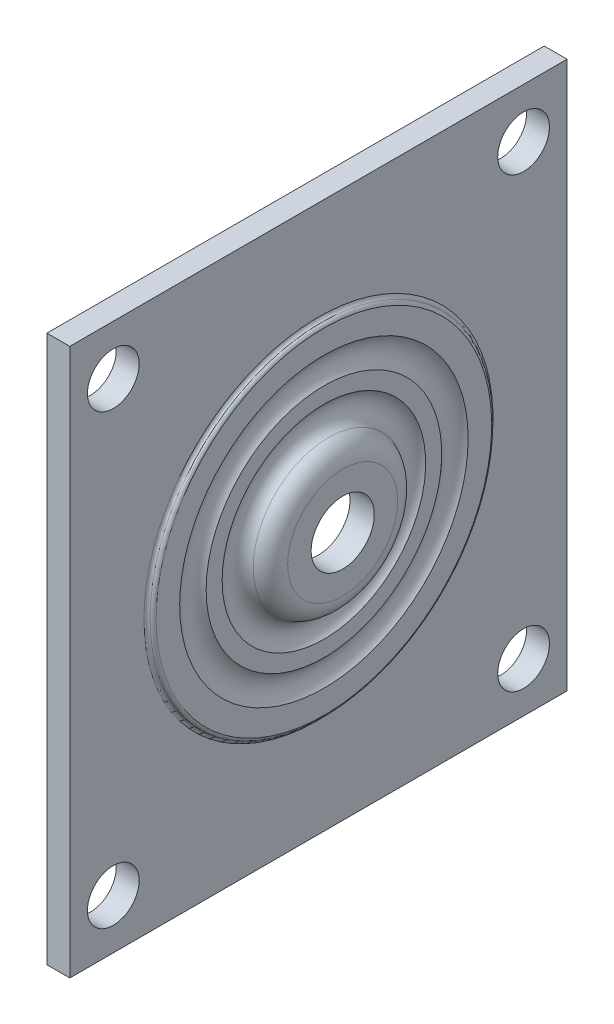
ISO-10303-21;
HEADER;
FILE_DESCRIPTION(('STEP AP214'),'2;1');
FILE_NAME('part.step','',(''),(''),'','','');
FILE_SCHEMA(('AUTOMOTIVE_DESIGN { 1 0 10303 214 1 1 1 1 }'));
ENDSEC;
DATA;
#1=APPLICATION_CONTEXT('core data for automotive mechanical design processes');
#2=APPLICATION_PROTOCOL_DEFINITION('international standard','automotive_design',2000,#1);
#3=PRODUCT_CONTEXT('',#1,'mechanical');
#4=PRODUCT('Part','Part','',(#3));
#5=PRODUCT_RELATED_PRODUCT_CATEGORY('part','',(#4));
#6=PRODUCT_DEFINITION_FORMATION('','',#4);
#7=PRODUCT_DEFINITION_CONTEXT('part definition',#1,'design');
#8=PRODUCT_DEFINITION('design','',#6,#7);
#9=PRODUCT_DEFINITION_SHAPE('','',#8);
#10=(LENGTH_UNIT() NAMED_UNIT(*) SI_UNIT(.MILLI.,.METRE.));
#11=(NAMED_UNIT(*) PLANE_ANGLE_UNIT() SI_UNIT($,.RADIAN.));
#12=(NAMED_UNIT(*) SI_UNIT($,.STERADIAN.) SOLID_ANGLE_UNIT());
#13=UNCERTAINTY_MEASURE_WITH_UNIT(LENGTH_MEASURE(1.E-05),#10,'distance_accuracy_value','');
#14=(GEOMETRIC_REPRESENTATION_CONTEXT(3) GLOBAL_UNCERTAINTY_ASSIGNED_CONTEXT((#13)) GLOBAL_UNIT_ASSIGNED_CONTEXT((#10,
#11,#12)) REPRESENTATION_CONTEXT('',''));
#15=CARTESIAN_POINT('',(0.,0.,0.));
#16=DIRECTION('',(0.,0.,1.));
#17=DIRECTION('',(1.,0.,0.));
#18=AXIS2_PLACEMENT_3D('',#15,#16,#17);
#19=CARTESIAN_POINT('',(6.19759999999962,14.0562775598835,0.));
#20=DIRECTION('',(-1.,0.,0.));
#21=DIRECTION('',(0.,0.,1.));
#22=AXIS2_PLACEMENT_3D('',#19,#20,#21);
#23=PLANE('',#22);
#24=CARTESIAN_POINT('',(6.19759999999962,0.,0.));
#25=DIRECTION('',(-1.,0.,0.));
#26=DIRECTION('',(0.,0.,1.));
#27=AXIS2_PLACEMENT_3D('',#24,#25,#26);
#28=CIRCLE('',#27,8.0645);
#29=CARTESIAN_POINT('',(6.19759999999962,0.,8.0645));
#30=VERTEX_POINT('',#29);
#31=EDGE_CURVE('E19',#30,#30,#28,.T.);
#32=ORIENTED_EDGE('',*,*,#31,.T.);
#33=EDGE_LOOP('',(#32));
#34=FACE_BOUND('',#33,.T.);
#35=CARTESIAN_POINT('',(6.19759999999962,0.,0.));
#36=DIRECTION('',(-1.,0.,0.));
#37=DIRECTION('',(0.,0.,1.));
#38=AXIS2_PLACEMENT_3D('',#35,#36,#37);
#39=CIRCLE('',#38,14.0562775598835);
#40=CARTESIAN_POINT('',(6.19759999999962,0.,14.0562775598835));
#41=VERTEX_POINT('',#40);
#42=EDGE_CURVE('E199',#41,#41,#39,.T.);
#43=ORIENTED_EDGE('',*,*,#42,.F.);
#44=EDGE_LOOP('',(#43));
#45=FACE_BOUND('',#44,.T.);
#46=ADVANCED_FACE('F15',(#34,#45),#23,.F.);
#47=CARTESIAN_POINT('',(0.660399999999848,0.,0.));
#48=DIRECTION('',(-1.,0.,0.));
#49=DIRECTION('',(0.,0.,1.));
#50=AXIS2_PLACEMENT_3D('',#47,#48,#49);
#51=TOROIDAL_SURFACE('',#50,14.0562775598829,5.53719999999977);
#52=CARTESIAN_POINT('',(2.58750835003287,0.,0.));
#53=DIRECTION('',(-1.,0.,0.));
#54=DIRECTION('',(0.,0.,1.));
#55=AXIS2_PLACEMENT_3D('',#52,#53,#54);
#56=CIRCLE('',#55,19.2473118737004);
#57=CARTESIAN_POINT('',(2.58750835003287,0.,19.2473118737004));
#58=VERTEX_POINT('',#57);
#59=EDGE_CURVE('E174',#58,#58,#56,.F.);
#60=ORIENTED_EDGE('',*,*,#59,.T.);
#61=EDGE_LOOP('',(#60));
#62=FACE_BOUND('',#61,.T.);
#63=ORIENTED_EDGE('',*,*,#42,.T.);
#64=EDGE_LOOP('',(#63));
#65=FACE_BOUND('',#64,.T.);
#66=ADVANCED_FACE('F185',(#62,#65),#51,.T.);
#67=CARTESIAN_POINT('',(6.27955056E-11,0.,0.));
#68=DIRECTION('',(-1.,0.,0.));
#69=DIRECTION('',(0.,0.,1.));
#70=AXIS2_PLACEMENT_3D('',#67,#68,#69);
#71=CYLINDRICAL_SURFACE('',#70,8.0645);
#72=CARTESIAN_POINT('',(-3.38070444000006E-13,0.,0.));
#73=DIRECTION('',(-1.,0.,0.));
#74=DIRECTION('',(0.,0.,1.));
#75=AXIS2_PLACEMENT_3D('',#72,#73,#74);
#76=CIRCLE('',#75,8.0645);
#77=CARTESIAN_POINT('',(-3.38070444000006E-13,0.,8.0645));
#78=VERTEX_POINT('',#77);
#79=EDGE_CURVE('E265',#78,#78,#76,.T.);
#80=ORIENTED_EDGE('',*,*,#79,.T.);
#81=EDGE_LOOP('',(#80));
#82=FACE_BOUND('',#81,.T.);
#83=ORIENTED_EDGE('',*,*,#31,.F.);
#84=EDGE_LOOP('',(#83));
#85=FACE_BOUND('',#84,.T.);
#86=ADVANCED_FACE('F181',(#82,#85),#71,.F.);
#87=CARTESIAN_POINT('',(3.96874999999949,0.,0.));
#88=DIRECTION('',(-1.,0.,0.));
#89=DIRECTION('',(0.,0.,1.));
#90=AXIS2_PLACEMENT_3D('',#87,#88,#89);
#91=TOROIDAL_SURFACE('',#90,22.9679500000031,3.96875);
#92=ORIENTED_EDGE('',*,*,#59,.F.);
#93=EDGE_LOOP('',(#92));
#94=FACE_BOUND('',#93,.T.);
#95=CARTESIAN_POINT('',(1.39699999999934,0.,0.));
#96=DIRECTION('',(-1.,0.,0.));
#97=DIRECTION('',(0.,0.,1.));
#98=AXIS2_PLACEMENT_3D('',#95,#96,#97);
#99=CIRCLE('',#98,25.9907100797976);
#100=CARTESIAN_POINT('',(1.39699999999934,0.,25.9907100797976));
#101=VERTEX_POINT('',#100);
#102=EDGE_CURVE('E263',#101,#101,#99,.F.);
#103=ORIENTED_EDGE('',*,*,#102,.T.);
#104=EDGE_LOOP('',(#103));
#105=FACE_BOUND('',#104,.T.);
#106=ADVANCED_FACE('F177',(#94,#105),#91,.F.);
#107=CARTESIAN_POINT('',(-3.39146642E-13,12.417552,0.));
#108=DIRECTION('',(1.,0.,0.));
#109=DIRECTION('',(0.,0.,-1.));
#110=AXIS2_PLACEMENT_3D('',#107,#108,#109);
#111=PLANE('',#110);
#112=ORIENTED_EDGE('',*,*,#79,.F.);
#113=EDGE_LOOP('',(#112));
#114=FACE_BOUND('',#113,.T.);
#115=CARTESIAN_POINT('',(-3.30031141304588E-13,0.,0.));
#116=DIRECTION('',(1.,0.,0.));
#117=DIRECTION('',(0.,0.,1.));
#118=AXIS2_PLACEMENT_3D('',#115,#116,#117);
#119=CIRCLE('',#118,12.417552);
#120=CARTESIAN_POINT('',(-3.30031141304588E-13,0.,12.417552));
#121=VERTEX_POINT('',#120);
#122=EDGE_CURVE('E262',#121,#121,#119,.F.);
#123=ORIENTED_EDGE('',*,*,#122,.T.);
#124=EDGE_LOOP('',(#123));
#125=FACE_BOUND('',#124,.T.);
#126=ADVANCED_FACE('F180',(#114,#125),#111,.F.);
#127=CARTESIAN_POINT('',(1.39699999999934,30.0768481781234,0.));
#128=DIRECTION('',(-1.,0.,0.));
#129=DIRECTION('',(0.,0.,1.));
#130=AXIS2_PLACEMENT_3D('',#127,#128,#129);
#131=PLANE('',#130);
#132=ORIENTED_EDGE('',*,*,#102,.F.);
#133=EDGE_LOOP('',(#132));
#134=FACE_BOUND('',#133,.T.);
#135=CARTESIAN_POINT('',(1.39699999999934,0.,0.));
#136=DIRECTION('',(-1.,0.,0.));
#137=DIRECTION('',(0.,0.,1.));
#138=AXIS2_PLACEMENT_3D('',#135,#136,#137);
#139=CIRCLE('',#138,30.0768481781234);
#140=CARTESIAN_POINT('',(1.39699999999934,0.,30.0768481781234));
#141=VERTEX_POINT('',#140);
#142=EDGE_CURVE('E259',#141,#141,#139,.F.);
#143=ORIENTED_EDGE('',*,*,#142,.T.);
#144=EDGE_LOOP('',(#143));
#145=FACE_BOUND('',#144,.T.);
#146=ADVANCED_FACE('F158',(#134,#145),#131,.F.);
#147=CARTESIAN_POINT('',(-1.58750000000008,0.,0.));
#148=DIRECTION('',(-1.,0.,0.));
#149=DIRECTION('',(0.,0.,1.));
#150=AXIS2_PLACEMENT_3D('',#147,#148,#149);
#151=TOROIDAL_SURFACE('',#150,12.4175520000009,1.58749999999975);
#152=CARTESIAN_POINT('',(-1.29822222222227,0.,0.));
#153=DIRECTION('',(-1.,0.,0.));
#154=DIRECTION('',(0.,0.,1.));
#155=AXIS2_PLACEMENT_3D('',#152,#153,#154);
#156=CIRCLE('',#155,13.978473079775);
#157=CARTESIAN_POINT('',(-1.29822222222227,0.,13.978473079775));
#158=VERTEX_POINT('',#157);
#159=EDGE_CURVE('E258',#158,#158,#156,.F.);
#160=ORIENTED_EDGE('',*,*,#159,.F.);
#161=EDGE_LOOP('',(#160));
#162=FACE_BOUND('',#161,.T.);
#163=ORIENTED_EDGE('',*,*,#122,.F.);
#164=EDGE_LOOP('',(#163));
#165=FACE_BOUND('',#164,.T.);
#166=ADVANCED_FACE('F154',(#162,#165),#151,.F.);
#167=CARTESIAN_POINT('',(4.7751999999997,0.,0.));
#168=DIRECTION('',(-1.,0.,0.));
#169=DIRECTION('',(0.,0.,1.));
#170=AXIS2_PLACEMENT_3D('',#167,#168,#169);
#171=TOROIDAL_SURFACE('',#170,33.4518000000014,4.77519999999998);
#172=ORIENTED_EDGE('',*,*,#142,.F.);
#173=EDGE_LOOP('',(#172));
#174=FACE_BOUND('',#173,.T.);
#175=CARTESIAN_POINT('',(1.39700000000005,0.,0.));
#176=DIRECTION('',(-1.,0.,0.));
#177=DIRECTION('',(0.,0.,1.));
#178=AXIS2_PLACEMENT_3D('',#175,#176,#177);
#179=CIRCLE('',#178,36.82675182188);
#180=CARTESIAN_POINT('',(1.39700000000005,0.,36.82675182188));
#181=VERTEX_POINT('',#180);
#182=EDGE_CURVE('E255',#181,#181,#179,.F.);
#183=ORIENTED_EDGE('',*,*,#182,.T.);
#184=EDGE_LOOP('',(#183));
#185=FACE_BOUND('',#184,.T.);
#186=ADVANCED_FACE('F134',(#174,#185),#171,.F.);
#187=CARTESIAN_POINT('',(-0.285749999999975,0.,0.));
#188=DIRECTION('',(-1.,0.,0.));
#189=DIRECTION('',(0.,0.,1.));
#190=AXIS2_PLACEMENT_3D('',#187,#188,#189);
#191=TOROIDAL_SURFACE('',#190,19.4416968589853,5.55625000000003);
#192=ORIENTED_EDGE('',*,*,#159,.T.);
#193=EDGE_LOOP('',(#192));
#194=FACE_BOUND('',#193,.T.);
#195=CARTESIAN_POINT('',(-5.842,0.,0.));
#196=DIRECTION('',(-1.,0.,0.));
#197=DIRECTION('',(0.,0.,1.));
#198=AXIS2_PLACEMENT_3D('',#195,#196,#197);
#199=CIRCLE('',#198,19.4416968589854);
#200=CARTESIAN_POINT('',(-5.842,0.,19.4416968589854));
#201=VERTEX_POINT('',#200);
#202=EDGE_CURVE('E111',#201,#201,#199,.T.);
#203=ORIENTED_EDGE('',*,*,#202,.T.);
#204=EDGE_LOOP('',(#203));
#205=FACE_BOUND('',#204,.T.);
#206=ADVANCED_FACE('F129',(#194,#205),#191,.T.);
#207=CARTESIAN_POINT('',(1.39700000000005,42.8341143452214,0.));
#208=DIRECTION('',(-1.,0.,0.));
#209=DIRECTION('',(0.,0.,1.));
#210=AXIS2_PLACEMENT_3D('',#207,#208,#209);
#211=PLANE('',#210);
#212=ORIENTED_EDGE('',*,*,#182,.F.);
#213=EDGE_LOOP('',(#212));
#214=FACE_BOUND('',#213,.T.);
#215=CARTESIAN_POINT('',(1.39700000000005,0.,0.));
#216=DIRECTION('',(-1.,0.,0.));
#217=DIRECTION('',(0.,0.,1.));
#218=AXIS2_PLACEMENT_3D('',#215,#216,#217);
#219=CIRCLE('',#218,42.8341143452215);
#220=CARTESIAN_POINT('',(1.39700000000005,0.,42.8341143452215));
#221=VERTEX_POINT('',#220);
#222=EDGE_CURVE('E252',#221,#221,#219,.T.);
#223=ORIENTED_EDGE('',*,*,#222,.F.);
#224=EDGE_LOOP('',(#223));
#225=FACE_BOUND('',#224,.T.);
#226=ADVANCED_FACE('F126',(#214,#225),#211,.F.);
#227=CARTESIAN_POINT('',(-5.842,24.2558200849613,0.));
#228=DIRECTION('',(1.,0.,0.));
#229=DIRECTION('',(0.,0.,-1.));
#230=AXIS2_PLACEMENT_3D('',#227,#228,#229);
#231=PLANE('',#230);
#232=ORIENTED_EDGE('',*,*,#202,.F.);
#233=EDGE_LOOP('',(#232));
#234=FACE_BOUND('',#233,.T.);
#235=CARTESIAN_POINT('',(-5.842,0.,0.));
#236=DIRECTION('',(-1.,0.,0.));
#237=DIRECTION('',(0.,0.,1.));
#238=AXIS2_PLACEMENT_3D('',#235,#236,#237);
#239=CIRCLE('',#238,24.2558200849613);
#240=CARTESIAN_POINT('',(-5.842,0.,24.2558200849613));
#241=VERTEX_POINT('',#240);
#242=EDGE_CURVE('E249',#241,#241,#239,.T.);
#243=ORIENTED_EDGE('',*,*,#242,.T.);
#244=EDGE_LOOP('',(#243));
#245=FACE_BOUND('',#244,.T.);
#246=ADVANCED_FACE('F117',(#234,#245),#231,.F.);
#247=CARTESIAN_POINT('',(0.298557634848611,0.,0.));
#248=DIRECTION('',(-1.,0.,0.));
#249=DIRECTION('',(0.,0.,1.));
#250=AXIS2_PLACEMENT_3D('',#247,#248,#249);
#251=TOROIDAL_SURFACE('',#250,42.6617420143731,1.11188481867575);
#252=CARTESIAN_POINT('',(0.6985,0.,0.));
#253=DIRECTION('',(-1.,0.,0.));
#254=DIRECTION('',(0.,0.,1.));
#255=AXIS2_PLACEMENT_3D('',#252,#253,#254);
#256=CIRCLE('',#255,43.6992071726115);
#257=CARTESIAN_POINT('',(0.6985,0.,43.6992071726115));
#258=VERTEX_POINT('',#257);
#259=EDGE_CURVE('E85',#258,#258,#256,.F.);
#260=ORIENTED_EDGE('',*,*,#259,.T.);
#261=EDGE_LOOP('',(#260));
#262=FACE_BOUND('',#261,.T.);
#263=ORIENTED_EDGE('',*,*,#222,.T.);
#264=EDGE_LOOP('',(#263));
#265=FACE_BOUND('',#264,.T.);
#266=ADVANCED_FACE('F99',(#262,#265),#251,.T.);
#267=CARTESIAN_POINT('',(-9.34720000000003,0.,0.));
#268=DIRECTION('',(-1.,0.,0.));
#269=DIRECTION('',(0.,0.,1.));
#270=AXIS2_PLACEMENT_3D('',#267,#268,#269);
#271=TOROIDAL_SURFACE('',#270,27.4986750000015,4.77520000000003);
#272=CARTESIAN_POINT('',(-5.84199999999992,0.,0.));
#273=DIRECTION('',(-1.,0.,0.));
#274=DIRECTION('',(0.,0.,1.));
#275=AXIS2_PLACEMENT_3D('',#272,#273,#274);
#276=CIRCLE('',#275,30.7415299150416);
#277=CARTESIAN_POINT('',(-5.84199999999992,0.,30.7415299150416));
#278=VERTEX_POINT('',#277);
#279=EDGE_CURVE('E246',#278,#278,#276,.T.);
#280=ORIENTED_EDGE('',*,*,#279,.T.);
#281=EDGE_LOOP('',(#280));
#282=FACE_BOUND('',#281,.T.);
#283=ORIENTED_EDGE('',*,*,#242,.F.);
#284=EDGE_LOOP('',(#283));
#285=FACE_BOUND('',#284,.T.);
#286=ADVANCED_FACE('F93',(#282,#285),#271,.F.);
#287=CARTESIAN_POINT('',(1.09844236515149,0.,0.));
#288=DIRECTION('',(-1.,0.,0.));
#289=DIRECTION('',(0.,0.,1.));
#290=AXIS2_PLACEMENT_3D('',#287,#288,#289);
#291=TOROIDAL_SURFACE('',#290,44.7366723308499,1.11188481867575);
#292=ORIENTED_EDGE('',*,*,#259,.F.);
#293=EDGE_LOOP('',(#292));
#294=FACE_BOUND('',#293,.T.);
#295=CARTESIAN_POINT('',(0.,0.,0.));
#296=DIRECTION('',(-1.,0.,0.));
#297=DIRECTION('',(0.,0.,1.));
#298=AXIS2_PLACEMENT_3D('',#295,#296,#297);
#299=CIRCLE('',#298,44.5643000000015);
#300=CARTESIAN_POINT('',(0.,0.,44.5643000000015));
#301=VERTEX_POINT('',#300);
#302=EDGE_CURVE('E69',#301,#301,#299,.F.);
#303=ORIENTED_EDGE('',*,*,#302,.T.);
#304=EDGE_LOOP('',(#303));
#305=FACE_BOUND('',#304,.T.);
#306=ADVANCED_FACE('F88',(#294,#305),#291,.F.);
#307=CARTESIAN_POINT('',(-5.84199999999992,37.1722166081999,0.));
#308=DIRECTION('',(1.,0.,0.));
#309=DIRECTION('',(0.,0.,-1.));
#310=AXIS2_PLACEMENT_3D('',#307,#308,#309);
#311=PLANE('',#310);
#312=ORIENTED_EDGE('',*,*,#279,.F.);
#313=EDGE_LOOP('',(#312));
#314=FACE_BOUND('',#313,.T.);
#315=CARTESIAN_POINT('',(-5.84199999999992,0.,0.));
#316=DIRECTION('',(-1.,0.,0.));
#317=DIRECTION('',(0.,0.,1.));
#318=AXIS2_PLACEMENT_3D('',#315,#316,#317);
#319=CIRCLE('',#318,37.1722166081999);
#320=CARTESIAN_POINT('',(-5.84199999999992,0.,37.1722166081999));
#321=VERTEX_POINT('',#320);
#322=EDGE_CURVE('E232',#321,#321,#319,.T.);
#323=ORIENTED_EDGE('',*,*,#322,.T.);
#324=EDGE_LOOP('',(#323));
#325=FACE_BOUND('',#324,.T.);
#326=ADVANCED_FACE('F92',(#314,#325),#311,.F.);
#327=CARTESIAN_POINT('',(0.,80.9625,0.));
#328=DIRECTION('',(-1.,0.,0.));
#329=DIRECTION('',(0.,0.,1.));
#330=AXIS2_PLACEMENT_3D('',#327,#328,#329);
#331=PLANE('',#330);
#332=ORIENTED_EDGE('',*,*,#302,.F.);
#333=EDGE_LOOP('',(#332));
#334=FACE_BOUND('',#333,.T.);
#335=CARTESIAN_POINT('',(0.,-57.15,-52.3875));
#336=DIRECTION('',(-1.,0.,0.));
#337=DIRECTION('',(0.,0.,1.));
#338=AXIS2_PLACEMENT_3D('',#335,#336,#337);
#339=CIRCLE('',#338,6.604);
#340=CARTESIAN_POINT('',(0.,-57.15,-45.7835));
#341=VERTEX_POINT('',#340);
#342=EDGE_CURVE('E229',#341,#341,#339,.T.);
#343=ORIENTED_EDGE('',*,*,#342,.T.);
#344=EDGE_LOOP('',(#343));
#345=FACE_BOUND('',#344,.T.);
#346=CARTESIAN_POINT('',(0.,57.15,-52.3875));
#347=DIRECTION('',(-1.,0.,0.));
#348=DIRECTION('',(0.,0.,1.));
#349=AXIS2_PLACEMENT_3D('',#346,#347,#348);
#350=CIRCLE('',#349,6.604);
#351=CARTESIAN_POINT('',(0.,57.15,-45.7835));
#352=VERTEX_POINT('',#351);
#353=EDGE_CURVE('E235',#352,#352,#350,.T.);
#354=ORIENTED_EDGE('',*,*,#353,.T.);
#355=EDGE_LOOP('',(#354));
#356=FACE_BOUND('',#355,.T.);
#357=CARTESIAN_POINT('',(0.,57.15,52.3875));
#358=DIRECTION('',(-1.,0.,0.));
#359=DIRECTION('',(0.,0.,1.));
#360=AXIS2_PLACEMENT_3D('',#357,#358,#359);
#361=CIRCLE('',#360,6.604);
#362=CARTESIAN_POINT('',(0.,57.15,58.9915));
#363=VERTEX_POINT('',#362);
#364=EDGE_CURVE('E238',#363,#363,#361,.T.);
#365=ORIENTED_EDGE('',*,*,#364,.T.);
#366=EDGE_LOOP('',(#365));
#367=FACE_BOUND('',#366,.T.);
#368=CARTESIAN_POINT('',(0.,-57.15,52.3875));
#369=DIRECTION('',(-1.,0.,0.));
#370=DIRECTION('',(0.,0.,1.));
#371=AXIS2_PLACEMENT_3D('',#368,#369,#370);
#372=CIRCLE('',#371,6.604);
#373=CARTESIAN_POINT('',(0.,-57.15,58.9915));
#374=VERTEX_POINT('',#373);
#375=EDGE_CURVE('E241',#374,#374,#372,.T.);
#376=ORIENTED_EDGE('',*,*,#375,.T.);
#377=EDGE_LOOP('',(#376));
#378=FACE_BOUND('',#377,.T.);
#379=DIRECTION('',(0.,0.,1.));
#380=VECTOR('',#379,1.);
#381=CARTESIAN_POINT('',(0.,-69.85,63.5));
#382=LINE('',#381,#380);
#383=CARTESIAN_POINT('',(0.,-69.85,63.5));
#384=VERTEX_POINT('',#383);
#385=CARTESIAN_POINT('',(0.,-69.85,-63.5));
#386=VERTEX_POINT('',#385);
#387=EDGE_CURVE('E53',#384,#386,#382,.F.);
#388=ORIENTED_EDGE('',*,*,#387,.T.);
#389=DIRECTION('',(0.,1.,0.));
#390=VECTOR('',#389,1.);
#391=CARTESIAN_POINT('',(0.,80.9625,-63.5));
#392=LINE('',#391,#390);
#393=CARTESIAN_POINT('',(0.,69.85,-63.5));
#394=VERTEX_POINT('',#393);
#395=EDGE_CURVE('E63',#386,#394,#392,.T.);
#396=ORIENTED_EDGE('',*,*,#395,.T.);
#397=DIRECTION('',(0.,0.,-1.));
#398=VECTOR('',#397,1.);
#399=CARTESIAN_POINT('',(0.,69.85,63.5));
#400=LINE('',#399,#398);
#401=CARTESIAN_POINT('',(0.,69.85,63.5));
#402=VERTEX_POINT('',#401);
#403=EDGE_CURVE('E58',#394,#402,#400,.F.);
#404=ORIENTED_EDGE('',*,*,#403,.T.);
#405=DIRECTION('',(0.,1.,0.));
#406=VECTOR('',#405,1.);
#407=CARTESIAN_POINT('',(0.,80.9625,63.5));
#408=LINE('',#407,#406);
#409=EDGE_CURVE('E61',#402,#384,#408,.F.);
#410=ORIENTED_EDGE('',*,*,#409,.T.);
#411=EDGE_LOOP('',(#388,#396,#404,#410));
#412=FACE_BOUND('',#411,.T.);
#413=ADVANCED_FACE('F60',(#334,#345,#356,#367,#378,#412),#331,.F.);
#414=CARTESIAN_POINT('',(6.19759999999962,69.85,63.5));
#415=DIRECTION('',(0.,-1.,0.));
#416=DIRECTION('',(0.,0.,-1.));
#417=AXIS2_PLACEMENT_3D('',#414,#415,#416);
#418=PLANE('',#417);
#419=DIRECTION('',(0.,0.,-1.));
#420=VECTOR('',#419,1.);
#421=CARTESIAN_POINT('',(-5.84199999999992,69.85,0.));
#422=LINE('',#421,#420);
#423=CARTESIAN_POINT('',(-5.84199999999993,69.85,-63.5));
#424=VERTEX_POINT('',#423);
#425=CARTESIAN_POINT('',(-5.84199999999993,69.85,63.5));
#426=VERTEX_POINT('',#425);
#427=EDGE_CURVE('E79',#424,#426,#422,.F.);
#428=ORIENTED_EDGE('',*,*,#427,.T.);
#429=DIRECTION('',(-1.,0.,0.));
#430=VECTOR('',#429,1.);
#431=CARTESIAN_POINT('',(162.863883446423,69.85,63.5));
#432=LINE('',#431,#430);
#433=EDGE_CURVE('E68',#426,#402,#432,.F.);
#434=ORIENTED_EDGE('',*,*,#433,.T.);
#435=ORIENTED_EDGE('',*,*,#403,.F.);
#436=DIRECTION('',(1.,0.,0.));
#437=VECTOR('',#436,1.);
#438=CARTESIAN_POINT('',(162.863883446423,69.85,-63.5));
#439=LINE('',#438,#437);
#440=EDGE_CURVE('E304',#394,#424,#439,.F.);
#441=ORIENTED_EDGE('',*,*,#440,.T.);
#442=EDGE_LOOP('',(#428,#434,#435,#441));
#443=FACE_BOUND('',#442,.T.);
#444=ADVANCED_FACE('F78',(#443),#418,.F.);
#445=CARTESIAN_POINT('',(162.863883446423,80.9625,63.5));
#446=DIRECTION('',(0.,0.,-1.));
#447=DIRECTION('',(-1.,0.,0.));
#448=AXIS2_PLACEMENT_3D('',#445,#446,#447);
#449=PLANE('',#448);
#450=DIRECTION('',(1.,0.,0.));
#451=VECTOR('',#450,1.);
#452=CARTESIAN_POINT('',(6.19759999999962,-69.85,63.5));
#453=LINE('',#452,#451);
#454=CARTESIAN_POINT('',(-5.84199999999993,-69.85,63.5));
#455=VERTEX_POINT('',#454);
#456=EDGE_CURVE('E75',#455,#384,#453,.T.);
#457=ORIENTED_EDGE('',*,*,#456,.T.);
#458=ORIENTED_EDGE('',*,*,#409,.F.);
#459=ORIENTED_EDGE('',*,*,#433,.F.);
#460=DIRECTION('',(0.,1.,0.));
#461=VECTOR('',#460,1.);
#462=CARTESIAN_POINT('',(-5.84199999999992,80.9625,63.5));
#463=LINE('',#462,#461);
#464=EDGE_CURVE('E312',#426,#455,#463,.F.);
#465=ORIENTED_EDGE('',*,*,#464,.T.);
#466=EDGE_LOOP('',(#457,#458,#459,#465));
#467=FACE_BOUND('',#466,.T.);
#468=ADVANCED_FACE('F72',(#467),#449,.F.);
#469=CARTESIAN_POINT('',(6.19759999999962,-69.85,63.5));
#470=DIRECTION('',(0.,1.,0.));
#471=DIRECTION('',(0.,0.,1.));
#472=AXIS2_PLACEMENT_3D('',#469,#470,#471);
#473=PLANE('',#472);
#474=DIRECTION('',(0.,0.,-1.));
#475=VECTOR('',#474,1.);
#476=CARTESIAN_POINT('',(-5.84199999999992,-69.85,0.));
#477=LINE('',#476,#475);
#478=CARTESIAN_POINT('',(-5.84199999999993,-69.85,-63.5));
#479=VERTEX_POINT('',#478);
#480=EDGE_CURVE('E310',#455,#479,#477,.T.);
#481=ORIENTED_EDGE('',*,*,#480,.T.);
#482=DIRECTION('',(1.,0.,0.));
#483=VECTOR('',#482,1.);
#484=CARTESIAN_POINT('',(162.863883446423,-69.85,-63.5));
#485=LINE('',#484,#483);
#486=EDGE_CURVE('E34',#479,#386,#485,.T.);
#487=ORIENTED_EDGE('',*,*,#486,.T.);
#488=ORIENTED_EDGE('',*,*,#387,.F.);
#489=ORIENTED_EDGE('',*,*,#456,.F.);
#490=EDGE_LOOP('',(#481,#487,#488,#489));
#491=FACE_BOUND('',#490,.T.);
#492=ADVANCED_FACE('F308',(#491),#473,.F.);
#493=CARTESIAN_POINT('',(162.863883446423,80.9625,-63.5));
#494=DIRECTION('',(0.,0.,1.));
#495=DIRECTION('',(1.,0.,0.));
#496=AXIS2_PLACEMENT_3D('',#493,#494,#495);
#497=PLANE('',#496);
#498=ORIENTED_EDGE('',*,*,#486,.F.);
#499=DIRECTION('',(0.,1.,0.));
#500=VECTOR('',#499,1.);
#501=CARTESIAN_POINT('',(-5.84199999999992,80.9625,-63.5));
#502=LINE('',#501,#500);
#503=EDGE_CURVE('E228',#479,#424,#502,.T.);
#504=ORIENTED_EDGE('',*,*,#503,.T.);
#505=ORIENTED_EDGE('',*,*,#440,.F.);
#506=ORIENTED_EDGE('',*,*,#395,.F.);
#507=EDGE_LOOP('',(#498,#504,#505,#506));
#508=FACE_BOUND('',#507,.T.);
#509=ADVANCED_FACE('F306',(#508),#497,.F.);
#510=CARTESIAN_POINT('',(18.6789327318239,-57.15,52.3875));
#511=DIRECTION('',(-1.,0.,0.));
#512=DIRECTION('',(0.,0.,1.));
#513=AXIS2_PLACEMENT_3D('',#510,#511,#512);
#514=CYLINDRICAL_SURFACE('',#513,6.604);
#515=CARTESIAN_POINT('',(-5.84199999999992,-57.15,52.3875));
#516=DIRECTION('',(-1.,0.,0.));
#517=DIRECTION('',(0.,0.,1.));
#518=AXIS2_PLACEMENT_3D('',#515,#516,#517);
#519=CIRCLE('',#518,6.604);
#520=CARTESIAN_POINT('',(-5.84199999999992,-57.15,58.9915));
#521=VERTEX_POINT('',#520);
#522=EDGE_CURVE('E225',#521,#521,#519,.T.);
#523=ORIENTED_EDGE('',*,*,#522,.T.);
#524=EDGE_LOOP('',(#523));
#525=FACE_BOUND('',#524,.T.);
#526=ORIENTED_EDGE('',*,*,#375,.F.);
#527=EDGE_LOOP('',(#526));
#528=FACE_BOUND('',#527,.T.);
#529=ADVANCED_FACE('F321',(#525,#528),#514,.F.);
#530=CARTESIAN_POINT('',(18.6789327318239,57.15,52.3875));
#531=DIRECTION('',(-1.,0.,0.));
#532=DIRECTION('',(0.,0.,1.));
#533=AXIS2_PLACEMENT_3D('',#530,#531,#532);
#534=CYLINDRICAL_SURFACE('',#533,6.604);
#535=CARTESIAN_POINT('',(-5.84199999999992,57.15,52.3875));
#536=DIRECTION('',(-1.,0.,0.));
#537=DIRECTION('',(0.,0.,1.));
#538=AXIS2_PLACEMENT_3D('',#535,#536,#537);
#539=CIRCLE('',#538,6.604);
#540=CARTESIAN_POINT('',(-5.84199999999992,57.15,58.9915));
#541=VERTEX_POINT('',#540);
#542=EDGE_CURVE('E222',#541,#541,#539,.T.);
#543=ORIENTED_EDGE('',*,*,#542,.T.);
#544=EDGE_LOOP('',(#543));
#545=FACE_BOUND('',#544,.T.);
#546=ORIENTED_EDGE('',*,*,#364,.F.);
#547=EDGE_LOOP('',(#546));
#548=FACE_BOUND('',#547,.T.);
#549=ADVANCED_FACE('F344',(#545,#548),#534,.F.);
#550=CARTESIAN_POINT('',(18.6789327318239,57.15,-52.3875));
#551=DIRECTION('',(-1.,0.,0.));
#552=DIRECTION('',(0.,0.,1.));
#553=AXIS2_PLACEMENT_3D('',#550,#551,#552);
#554=CYLINDRICAL_SURFACE('',#553,6.604);
#555=CARTESIAN_POINT('',(-5.84199999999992,57.15,-52.3875));
#556=DIRECTION('',(-1.,0.,0.));
#557=DIRECTION('',(0.,0.,1.));
#558=AXIS2_PLACEMENT_3D('',#555,#556,#557);
#559=CIRCLE('',#558,6.604);
#560=CARTESIAN_POINT('',(-5.84199999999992,57.15,-45.7835));
#561=VERTEX_POINT('',#560);
#562=EDGE_CURVE('E219',#561,#561,#559,.T.);
#563=ORIENTED_EDGE('',*,*,#562,.T.);
#564=EDGE_LOOP('',(#563));
#565=FACE_BOUND('',#564,.T.);
#566=ORIENTED_EDGE('',*,*,#353,.F.);
#567=EDGE_LOOP('',(#566));
#568=FACE_BOUND('',#567,.T.);
#569=ADVANCED_FACE('F295',(#565,#568),#554,.F.);
#570=CARTESIAN_POINT('',(-9.34719999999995,0.,0.));
#571=DIRECTION('',(-1.,0.,0.));
#572=DIRECTION('',(0.,0.,1.));
#573=AXIS2_PLACEMENT_3D('',#570,#571,#572);
#574=TOROIDAL_SURFACE('',#573,40.4150715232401,4.77520000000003);
#575=CARTESIAN_POINT('',(-5.84199999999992,0.,0.));
#576=DIRECTION('',(-1.,0.,0.));
#577=DIRECTION('',(0.,0.,1.));
#578=AXIS2_PLACEMENT_3D('',#575,#576,#577);
#579=CIRCLE('',#578,43.6579264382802);
#580=CARTESIAN_POINT('',(-5.84199999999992,0.,43.6579264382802));
#581=VERTEX_POINT('',#580);
#582=EDGE_CURVE('E25',#581,#581,#579,.T.);
#583=ORIENTED_EDGE('',*,*,#582,.T.);
#584=EDGE_LOOP('',(#583));
#585=FACE_BOUND('',#584,.T.);
#586=ORIENTED_EDGE('',*,*,#322,.F.);
#587=EDGE_LOOP('',(#586));
#588=FACE_BOUND('',#587,.T.);
#589=ADVANCED_FACE('F286',(#585,#588),#574,.F.);
#590=CARTESIAN_POINT('',(18.6789327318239,-57.15,-52.3875));
#591=DIRECTION('',(-1.,0.,0.));
#592=DIRECTION('',(0.,0.,1.));
#593=AXIS2_PLACEMENT_3D('',#590,#591,#592);
#594=CYLINDRICAL_SURFACE('',#593,6.604);
#595=CARTESIAN_POINT('',(-5.84199999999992,-57.15,-52.3875));
#596=DIRECTION('',(-1.,0.,0.));
#597=DIRECTION('',(0.,0.,1.));
#598=AXIS2_PLACEMENT_3D('',#595,#596,#597);
#599=CIRCLE('',#598,6.604);
#600=CARTESIAN_POINT('',(-5.84199999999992,-57.15,-45.7835));
#601=VERTEX_POINT('',#600);
#602=EDGE_CURVE('E10',#601,#601,#599,.T.);
#603=ORIENTED_EDGE('',*,*,#602,.T.);
#604=EDGE_LOOP('',(#603));
#605=FACE_BOUND('',#604,.T.);
#606=ORIENTED_EDGE('',*,*,#342,.F.);
#607=EDGE_LOOP('',(#606));
#608=FACE_BOUND('',#607,.T.);
#609=ADVANCED_FACE('F280',(#605,#608),#594,.F.);
#610=CARTESIAN_POINT('',(-5.84199999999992,80.9625,0.));
#611=DIRECTION('',(1.,0.,0.));
#612=DIRECTION('',(0.,0.,-1.));
#613=AXIS2_PLACEMENT_3D('',#610,#611,#612);
#614=PLANE('',#613);
#615=ORIENTED_EDGE('',*,*,#602,.F.);
#616=EDGE_LOOP('',(#615));
#617=FACE_BOUND('',#616,.T.);
#618=ORIENTED_EDGE('',*,*,#582,.F.);
#619=EDGE_LOOP('',(#618));
#620=FACE_BOUND('',#619,.T.);
#621=ORIENTED_EDGE('',*,*,#562,.F.);
#622=EDGE_LOOP('',(#621));
#623=FACE_BOUND('',#622,.T.);
#624=ORIENTED_EDGE('',*,*,#542,.F.);
#625=EDGE_LOOP('',(#624));
#626=FACE_BOUND('',#625,.T.);
#627=ORIENTED_EDGE('',*,*,#522,.F.);
#628=EDGE_LOOP('',(#627));
#629=FACE_BOUND('',#628,.T.);
#630=ORIENTED_EDGE('',*,*,#480,.F.);
#631=ORIENTED_EDGE('',*,*,#464,.F.);
#632=ORIENTED_EDGE('',*,*,#427,.F.);
#633=ORIENTED_EDGE('',*,*,#503,.F.);
#634=EDGE_LOOP('',(#630,#631,#632,#633));
#635=FACE_BOUND('',#634,.T.);
#636=ADVANCED_FACE('F278',(#617,#620,#623,#626,#629,#635),#614,.F.);
#637=CLOSED_SHELL('',(#46,#66,#86,#106,#126,#146,#166,#186,#206,#226,#246,#266,#286,#306,#326,
#413,#444,#468,#492,#509,#529,#549,#569,#589,#609,#636));
#638=MANIFOLD_SOLID_BREP('B1',#637);
#639=ADVANCED_BREP_SHAPE_REPRESENTATION('',(#18,#638),#14);
#640=SHAPE_DEFINITION_REPRESENTATION(#9,#639);
ENDSEC;
END-ISO-10303-21;
